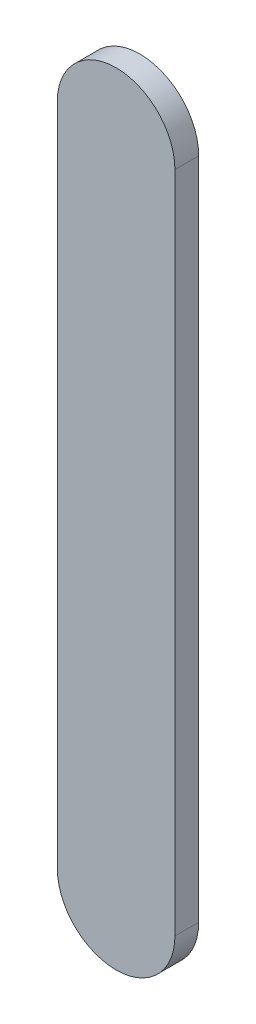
ISO-10303-21;
HEADER;
FILE_DESCRIPTION(('STEP AP214'),'2;1');
FILE_NAME('part.step','',(''),(''),'','','');
FILE_SCHEMA(('AUTOMOTIVE_DESIGN { 1 0 10303 214 1 1 1 1 }'));
ENDSEC;
DATA;
#1=APPLICATION_CONTEXT('core data for automotive mechanical design processes');
#2=APPLICATION_PROTOCOL_DEFINITION('international standard','automotive_design',2000,#1);
#3=PRODUCT_CONTEXT('',#1,'mechanical');
#4=PRODUCT('Part','Part','',(#3));
#5=PRODUCT_RELATED_PRODUCT_CATEGORY('part','',(#4));
#6=PRODUCT_DEFINITION_FORMATION('','',#4);
#7=PRODUCT_DEFINITION_CONTEXT('part definition',#1,'design');
#8=PRODUCT_DEFINITION('design','',#6,#7);
#9=PRODUCT_DEFINITION_SHAPE('','',#8);
#10=(LENGTH_UNIT() NAMED_UNIT(*) SI_UNIT(.MILLI.,.METRE.));
#11=(NAMED_UNIT(*) PLANE_ANGLE_UNIT() SI_UNIT($,.RADIAN.));
#12=(NAMED_UNIT(*) SI_UNIT($,.STERADIAN.) SOLID_ANGLE_UNIT());
#13=UNCERTAINTY_MEASURE_WITH_UNIT(LENGTH_MEASURE(1.E-05),#10,'distance_accuracy_value','');
#14=(GEOMETRIC_REPRESENTATION_CONTEXT(3) GLOBAL_UNCERTAINTY_ASSIGNED_CONTEXT((#13)) GLOBAL_UNIT_ASSIGNED_CONTEXT((#10,
#11,#12)) REPRESENTATION_CONTEXT('',''));
#15=CARTESIAN_POINT('',(0.,0.,0.));
#16=DIRECTION('',(0.,0.,1.));
#17=DIRECTION('',(1.,0.,0.));
#18=AXIS2_PLACEMENT_3D('',#15,#16,#17);
#19=CARTESIAN_POINT('',(0.,0.,15.));
#20=DIRECTION('',(0.,0.,-1.));
#21=DIRECTION('',(-1.,0.,0.));
#22=AXIS2_PLACEMENT_3D('',#19,#20,#21);
#23=CYLINDRICAL_SURFACE('',#22,37.13);
#24=CARTESIAN_POINT('',(0.,0.,0.));
#25=DIRECTION('',(0.,0.,1.));
#26=DIRECTION('',(1.,0.,0.));
#27=AXIS2_PLACEMENT_3D('',#24,#25,#26);
#28=CIRCLE('',#27,37.13);
#29=CARTESIAN_POINT('',(37.13,0.,0.));
#30=VERTEX_POINT('',#29);
#31=CARTESIAN_POINT('',(-37.13,0.,0.));
#32=VERTEX_POINT('',#31);
#33=EDGE_CURVE('E74',#30,#32,#28,.T.);
#34=ORIENTED_EDGE('',*,*,#33,.T.);
#35=DIRECTION('',(0.,0.,-1.));
#36=VECTOR('',#35,1.);
#37=CARTESIAN_POINT('',(-37.13,0.,15.));
#38=LINE('',#37,#36);
#39=CARTESIAN_POINT('',(-37.13,0.,15.));
#40=VERTEX_POINT('',#39);
#41=EDGE_CURVE('E11',#40,#32,#38,.T.);
#42=ORIENTED_EDGE('',*,*,#41,.F.);
#43=CARTESIAN_POINT('',(0.,0.,15.));
#44=DIRECTION('',(0.,0.,1.));
#45=DIRECTION('',(1.,0.,0.));
#46=AXIS2_PLACEMENT_3D('',#43,#44,#45);
#47=CIRCLE('',#46,37.13);
#48=CARTESIAN_POINT('',(37.13,0.,15.));
#49=VERTEX_POINT('',#48);
#50=EDGE_CURVE('E92',#49,#40,#47,.T.);
#51=ORIENTED_EDGE('',*,*,#50,.F.);
#52=DIRECTION('',(0.,0.,-1.));
#53=VECTOR('',#52,1.);
#54=CARTESIAN_POINT('',(37.13,0.,15.));
#55=LINE('',#54,#53);
#56=EDGE_CURVE('E86',#49,#30,#55,.T.);
#57=ORIENTED_EDGE('',*,*,#56,.T.);
#58=EDGE_LOOP('',(#34,#42,#51,#57));
#59=FACE_BOUND('',#58,.T.);
#60=ADVANCED_FACE('F30',(#59),#23,.T.);
#61=CARTESIAN_POINT('',(-37.13,0.,15.));
#62=DIRECTION('',(1.,0.,0.));
#63=DIRECTION('',(0.,1.,0.));
#64=AXIS2_PLACEMENT_3D('',#61,#62,#63);
#65=PLANE('',#64);
#66=DIRECTION('',(0.,-1.,0.));
#67=VECTOR('',#66,1.);
#68=CARTESIAN_POINT('',(-37.13,0.,0.));
#69=LINE('',#68,#67);
#70=CARTESIAN_POINT('',(-37.13,-419.,0.));
#71=VERTEX_POINT('',#70);
#72=EDGE_CURVE('E70',#32,#71,#69,.T.);
#73=ORIENTED_EDGE('',*,*,#72,.T.);
#74=DIRECTION('',(0.,0.,-1.));
#75=VECTOR('',#74,1.);
#76=CARTESIAN_POINT('',(-37.13,-419.,15.));
#77=LINE('',#76,#75);
#78=CARTESIAN_POINT('',(-37.13,-419.,15.));
#79=VERTEX_POINT('',#78);
#80=EDGE_CURVE('E37',#79,#71,#77,.T.);
#81=ORIENTED_EDGE('',*,*,#80,.F.);
#82=DIRECTION('',(0.,-1.,0.));
#83=VECTOR('',#82,1.);
#84=CARTESIAN_POINT('',(-37.13,0.,15.));
#85=LINE('',#84,#83);
#86=EDGE_CURVE('E82',#40,#79,#85,.T.);
#87=ORIENTED_EDGE('',*,*,#86,.F.);
#88=ORIENTED_EDGE('',*,*,#41,.T.);
#89=EDGE_LOOP('',(#73,#81,#87,#88));
#90=FACE_BOUND('',#89,.T.);
#91=ADVANCED_FACE('F81',(#90),#65,.F.);
#92=CARTESIAN_POINT('',(0.,-419.,15.));
#93=DIRECTION('',(0.,0.,-1.));
#94=DIRECTION('',(-1.,0.,0.));
#95=AXIS2_PLACEMENT_3D('',#92,#93,#94);
#96=CYLINDRICAL_SURFACE('',#95,37.13);
#97=CARTESIAN_POINT('',(0.,-419.,0.));
#98=DIRECTION('',(0.,0.,1.));
#99=DIRECTION('',(1.,0.,0.));
#100=AXIS2_PLACEMENT_3D('',#97,#98,#99);
#101=CIRCLE('',#100,37.13);
#102=CARTESIAN_POINT('',(37.13,-419.,0.));
#103=VERTEX_POINT('',#102);
#104=EDGE_CURVE('E75',#71,#103,#101,.T.);
#105=ORIENTED_EDGE('',*,*,#104,.T.);
#106=DIRECTION('',(0.,0.,-1.));
#107=VECTOR('',#106,1.);
#108=CARTESIAN_POINT('',(37.13,-419.,15.));
#109=LINE('',#108,#107);
#110=CARTESIAN_POINT('',(37.13,-419.,15.));
#111=VERTEX_POINT('',#110);
#112=EDGE_CURVE('E98',#111,#103,#109,.T.);
#113=ORIENTED_EDGE('',*,*,#112,.F.);
#114=CARTESIAN_POINT('',(0.,-419.,15.));
#115=DIRECTION('',(0.,0.,1.));
#116=DIRECTION('',(1.,0.,0.));
#117=AXIS2_PLACEMENT_3D('',#114,#115,#116);
#118=CIRCLE('',#117,37.13);
#119=EDGE_CURVE('E49',#79,#111,#118,.T.);
#120=ORIENTED_EDGE('',*,*,#119,.F.);
#121=ORIENTED_EDGE('',*,*,#80,.T.);
#122=EDGE_LOOP('',(#105,#113,#120,#121));
#123=FACE_BOUND('',#122,.T.);
#124=ADVANCED_FACE('F101',(#123),#96,.T.);
#125=CARTESIAN_POINT('',(37.13,0.,15.));
#126=DIRECTION('',(-1.,0.,0.));
#127=DIRECTION('',(0.,-1.,0.));
#128=AXIS2_PLACEMENT_3D('',#125,#126,#127);
#129=PLANE('',#128);
#130=DIRECTION('',(0.,1.,0.));
#131=VECTOR('',#130,1.);
#132=CARTESIAN_POINT('',(37.13,0.,0.));
#133=LINE('',#132,#131);
#134=EDGE_CURVE('E90',#103,#30,#133,.T.);
#135=ORIENTED_EDGE('',*,*,#134,.T.);
#136=ORIENTED_EDGE('',*,*,#56,.F.);
#137=DIRECTION('',(0.,1.,0.));
#138=VECTOR('',#137,1.);
#139=CARTESIAN_POINT('',(37.13,0.,15.));
#140=LINE('',#139,#138);
#141=EDGE_CURVE('E44',#111,#49,#140,.T.);
#142=ORIENTED_EDGE('',*,*,#141,.F.);
#143=ORIENTED_EDGE('',*,*,#112,.T.);
#144=EDGE_LOOP('',(#135,#136,#142,#143));
#145=FACE_BOUND('',#144,.T.);
#146=ADVANCED_FACE('F103',(#145),#129,.F.);
#147=CARTESIAN_POINT('',(0.,0.,15.));
#148=DIRECTION('',(0.,0.,1.));
#149=DIRECTION('',(1.,0.,0.));
#150=AXIS2_PLACEMENT_3D('',#147,#148,#149);
#151=PLANE('',#150);
#152=ORIENTED_EDGE('',*,*,#50,.T.);
#153=ORIENTED_EDGE('',*,*,#86,.T.);
#154=ORIENTED_EDGE('',*,*,#119,.T.);
#155=ORIENTED_EDGE('',*,*,#141,.T.);
#156=EDGE_LOOP('',(#152,#153,#154,#155));
#157=FACE_BOUND('',#156,.T.);
#158=ADVANCED_FACE('F104',(#157),#151,.T.);
#159=CARTESIAN_POINT('',(0.,0.,0.));
#160=DIRECTION('',(0.,0.,1.));
#161=DIRECTION('',(1.,0.,0.));
#162=AXIS2_PLACEMENT_3D('',#159,#160,#161);
#163=PLANE('',#162);
#164=ORIENTED_EDGE('',*,*,#33,.F.);
#165=ORIENTED_EDGE('',*,*,#134,.F.);
#166=ORIENTED_EDGE('',*,*,#104,.F.);
#167=ORIENTED_EDGE('',*,*,#72,.F.);
#168=EDGE_LOOP('',(#164,#165,#166,#167));
#169=FACE_BOUND('',#168,.T.);
#170=ADVANCED_FACE('F71',(#169),#163,.F.);
#171=CLOSED_SHELL('',(#60,#91,#124,#146,#158,#170));
#172=MANIFOLD_SOLID_BREP('B2',#171);
#173=ADVANCED_BREP_SHAPE_REPRESENTATION('',(#18,#172),#14);
#174=SHAPE_DEFINITION_REPRESENTATION(#9,#173);
ENDSEC;
END-ISO-10303-21;
